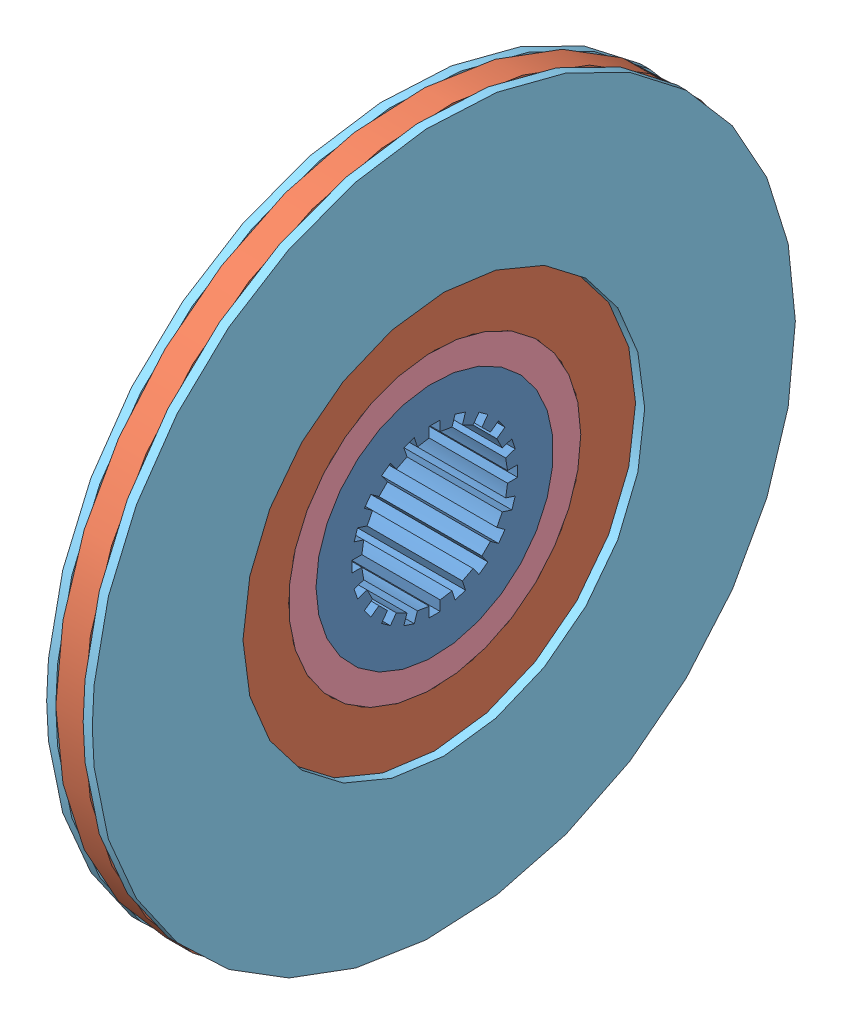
SolidWorks assembly 106 disque embrayage garni.SLDASM, configuration Défaut (file format 3100). Lengths in mm.
Overall size (95.02 385 385).
10 component instances, 6 part files, 6 mates.
Components (placement in the parent):
- 125 - disque embrayage-1: 125 - disque embrayage.SLDASM [Default] at (-124.6642 48.0888 0) size (80 385 385)
  - A - 125 - disque embrayage-1: A - 125 - disque embrayage.SLDPRT [Default] at (-15.2483 11.0028 0.5712) size (80 203.44 150)
  - B - 125 - disque embrayage-1: B - 125 - disque embrayage.SLDPRT [Default] at (50.7517 11.0028 0.5712) size (17.5 385 385)
  - bead1-1: bead1.sldprt [Défaut] at origin size (11.73 174.1 173.31)
  - bead2-1: bead2.sldprt [Défaut] at origin size (7.5 160 160)
- 106 A-1: 106 A.SLDPRT [Défaut] at (-51.4126 59.0916 0.5712) x (0 0 1) z (-1 0 0) size (385 385 5)
- 106 A-2: 106 A.SLDPRT [Défaut] at (-71.4126 59.0916 0.5712) x (0 0 1) z (-1 0 0) size (385 385 5)
- 060-RessCompr-1: 060-RessCompr.SLDPRT [Défaut] at (-144.4126 27.8416 -53.5554) size (24.57 14.44 14.55)
- 060-RessCompr-2: 060-RessCompr.SLDPRT [Défaut] at (-144.4126 27.8416 54.6978) x (1 0 0) z (0 0.866025 -0.5) size (24.57 14.44 14.55)
- 060-RessCompr-3: 060-RessCompr.SLDPRT [Défaut] at (-144.4126 121.5916 0.5712) x (1 0 0) z (0 -0.866025 -0.5) size (24.57 14.44 14.55)
Mates (geometry in assembly coordinates):
- Coaxiale1: concentric anti-aligned: cylinder of 125 - disque embrayage-1/B - 125 - disque embrayage-1; cylinder of 106 A-1
- Coïncidente2: coincident anti-aligned: plane of 125 - disque embrayage-1/B - 125 - disque embrayage-1 through (-56.4126 139.0916 0.5712) normal (1 0 0); plane of 106 A-1 through (-56.4126 59.0916 0.5712) normal (-1 0 0)
- Coïncidente3: coincident anti-aligned: plane of 125 - disque embrayage-1/B - 125 - disque embrayage-1 through (-71.4126 251.5916 0.5712) normal (-1 0 0); plane of 106 A-2 through (-71.4126 59.0916 0.5712) normal (1 0 0)
- Coaxiale3: concentric anti-aligned: cylinder of 125 - disque embrayage-1/B - 125 - disque embrayage-1; cylinder of 106 A-2
- Coïncidente4: coincident anti-aligned: axis of 125 - disque embrayage-1/A - 125 - disque embrayage-1; axis of 060-RessCompr-1
- Coïncidente5: coincident anti-aligned: circle of 125 - disque embrayage-1/A - 125 - disque embrayage-1 centre (-122.4126 27.8416 -53.5554) axis (-1 0 0); plane of 060-RessCompr-1 through (-122.4126 27.8416 -53.5554) normal (1 0 0)
